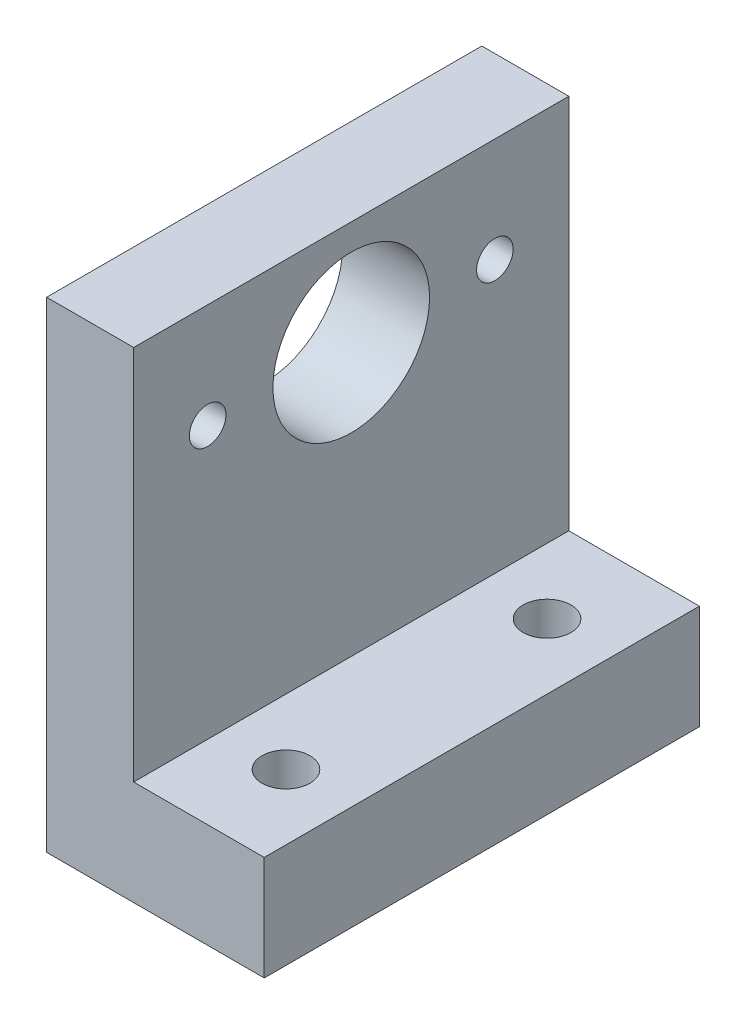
ISO-10303-21;
HEADER;
FILE_DESCRIPTION(('STEP AP214'),'2;1');
FILE_NAME('part.step','',(''),(''),'','','');
FILE_SCHEMA(('AUTOMOTIVE_DESIGN { 1 0 10303 214 1 1 1 1 }'));
ENDSEC;
DATA;
#1=APPLICATION_CONTEXT('core data for automotive mechanical design processes');
#2=APPLICATION_PROTOCOL_DEFINITION('international standard','automotive_design',2000,#1);
#3=PRODUCT_CONTEXT('',#1,'mechanical');
#4=PRODUCT('Part','Part','',(#3));
#5=PRODUCT_RELATED_PRODUCT_CATEGORY('part','',(#4));
#6=PRODUCT_DEFINITION_FORMATION('','',#4);
#7=PRODUCT_DEFINITION_CONTEXT('part definition',#1,'design');
#8=PRODUCT_DEFINITION('design','',#6,#7);
#9=PRODUCT_DEFINITION_SHAPE('','',#8);
#10=(LENGTH_UNIT() NAMED_UNIT(*) SI_UNIT(.MILLI.,.METRE.));
#11=(NAMED_UNIT(*) PLANE_ANGLE_UNIT() SI_UNIT($,.RADIAN.));
#12=(NAMED_UNIT(*) SI_UNIT($,.STERADIAN.) SOLID_ANGLE_UNIT());
#13=UNCERTAINTY_MEASURE_WITH_UNIT(LENGTH_MEASURE(1.E-05),#10,'distance_accuracy_value','');
#14=(GEOMETRIC_REPRESENTATION_CONTEXT(3) GLOBAL_UNCERTAINTY_ASSIGNED_CONTEXT((#13)) GLOBAL_UNIT_ASSIGNED_CONTEXT((#10,
#11,#12)) REPRESENTATION_CONTEXT('',''));
#15=CARTESIAN_POINT('',(0.,0.,0.));
#16=DIRECTION('',(0.,0.,1.));
#17=DIRECTION('',(1.,0.,0.));
#18=AXIS2_PLACEMENT_3D('',#15,#16,#17);
#19=CARTESIAN_POINT('',(0.,0.,50.));
#20=DIRECTION('',(0.,1.,0.));
#21=DIRECTION('',(0.,0.,1.));
#22=AXIS2_PLACEMENT_3D('',#19,#20,#21);
#23=PLANE('',#22);
#24=CARTESIAN_POINT('',(17.5,0.,40.));
#25=DIRECTION('',(0.,1.,0.));
#26=DIRECTION('',(0.,0.,1.));
#27=AXIS2_PLACEMENT_3D('',#24,#25,#26);
#28=CIRCLE('',#27,2.75);
#29=CARTESIAN_POINT('',(17.5,0.,42.75));
#30=VERTEX_POINT('',#29);
#31=EDGE_CURVE('E184',#30,#30,#28,.T.);
#32=ORIENTED_EDGE('',*,*,#31,.T.);
#33=EDGE_LOOP('',(#32));
#34=FACE_BOUND('',#33,.T.);
#35=CARTESIAN_POINT('',(17.5,0.,10.));
#36=DIRECTION('',(0.,1.,0.));
#37=DIRECTION('',(0.,0.,1.));
#38=AXIS2_PLACEMENT_3D('',#35,#36,#37);
#39=CIRCLE('',#38,2.75);
#40=CARTESIAN_POINT('',(17.5,0.,12.75));
#41=VERTEX_POINT('',#40);
#42=EDGE_CURVE('E187',#41,#41,#39,.T.);
#43=ORIENTED_EDGE('',*,*,#42,.T.);
#44=EDGE_LOOP('',(#43));
#45=FACE_BOUND('',#44,.T.);
#46=DIRECTION('',(0.,0.,-1.));
#47=VECTOR('',#46,1.);
#48=CARTESIAN_POINT('',(25.,0.,50.));
#49=LINE('',#48,#47);
#50=CARTESIAN_POINT('',(25.,0.,50.));
#51=VERTEX_POINT('',#50);
#52=CARTESIAN_POINT('',(25.,0.,0.));
#53=VERTEX_POINT('',#52);
#54=EDGE_CURVE('E12',#51,#53,#49,.T.);
#55=ORIENTED_EDGE('',*,*,#54,.F.);
#56=DIRECTION('',(1.,0.,0.));
#57=VECTOR('',#56,1.);
#58=CARTESIAN_POINT('',(0.,0.,50.));
#59=LINE('',#58,#57);
#60=CARTESIAN_POINT('',(0.,0.,50.));
#61=VERTEX_POINT('',#60);
#62=EDGE_CURVE('E86',#61,#51,#59,.T.);
#63=ORIENTED_EDGE('',*,*,#62,.F.);
#64=DIRECTION('',(0.,0.,-1.));
#65=VECTOR('',#64,1.);
#66=CARTESIAN_POINT('',(0.,0.,50.));
#67=LINE('',#66,#65);
#68=CARTESIAN_POINT('',(0.,0.,0.));
#69=VERTEX_POINT('',#68);
#70=EDGE_CURVE('E114',#61,#69,#67,.T.);
#71=ORIENTED_EDGE('',*,*,#70,.T.);
#72=DIRECTION('',(1.,0.,0.));
#73=VECTOR('',#72,1.);
#74=CARTESIAN_POINT('',(0.,0.,0.));
#75=LINE('',#74,#73);
#76=EDGE_CURVE('E118',#69,#53,#75,.T.);
#77=ORIENTED_EDGE('',*,*,#76,.T.);
#78=EDGE_LOOP('',(#55,#63,#71,#77));
#79=FACE_BOUND('',#78,.T.);
#80=ADVANCED_FACE('F33',(#34,#45,#79),#23,.F.);
#81=CARTESIAN_POINT('',(25.,0.,50.));
#82=DIRECTION('',(-1.,0.,0.));
#83=DIRECTION('',(0.,0.,1.));
#84=AXIS2_PLACEMENT_3D('',#81,#82,#83);
#85=PLANE('',#84);
#86=DIRECTION('',(0.,1.,0.));
#87=VECTOR('',#86,1.);
#88=CARTESIAN_POINT('',(25.,0.,0.));
#89=LINE('',#88,#87);
#90=CARTESIAN_POINT('',(25.,12.,0.));
#91=VERTEX_POINT('',#90);
#92=EDGE_CURVE('E120',#53,#91,#89,.T.);
#93=ORIENTED_EDGE('',*,*,#92,.T.);
#94=DIRECTION('',(0.,0.,-1.));
#95=VECTOR('',#94,1.);
#96=CARTESIAN_POINT('',(25.,12.,50.));
#97=LINE('',#96,#95);
#98=CARTESIAN_POINT('',(25.,12.,50.));
#99=VERTEX_POINT('',#98);
#100=EDGE_CURVE('E42',#99,#91,#97,.T.);
#101=ORIENTED_EDGE('',*,*,#100,.F.);
#102=DIRECTION('',(0.,1.,0.));
#103=VECTOR('',#102,1.);
#104=CARTESIAN_POINT('',(25.,0.,50.));
#105=LINE('',#104,#103);
#106=EDGE_CURVE('E152',#51,#99,#105,.T.);
#107=ORIENTED_EDGE('',*,*,#106,.F.);
#108=ORIENTED_EDGE('',*,*,#54,.T.);
#109=EDGE_LOOP('',(#93,#101,#107,#108));
#110=FACE_BOUND('',#109,.T.);
#111=ADVANCED_FACE('F156',(#110),#85,.F.);
#112=CARTESIAN_POINT('',(10.,12.,50.));
#113=DIRECTION('',(0.,-1.,0.));
#114=DIRECTION('',(0.,0.,-1.));
#115=AXIS2_PLACEMENT_3D('',#112,#113,#114);
#116=PLANE('',#115);
#117=CARTESIAN_POINT('',(17.5,12.,40.));
#118=DIRECTION('',(0.,1.,0.));
#119=DIRECTION('',(0.,0.,1.));
#120=AXIS2_PLACEMENT_3D('',#117,#118,#119);
#121=CIRCLE('',#120,2.75);
#122=CARTESIAN_POINT('',(17.5,12.,42.75));
#123=VERTEX_POINT('',#122);
#124=EDGE_CURVE('E195',#123,#123,#121,.T.);
#125=ORIENTED_EDGE('',*,*,#124,.F.);
#126=EDGE_LOOP('',(#125));
#127=FACE_BOUND('',#126,.T.);
#128=CARTESIAN_POINT('',(17.5,12.,10.));
#129=DIRECTION('',(0.,1.,0.));
#130=DIRECTION('',(0.,0.,1.));
#131=AXIS2_PLACEMENT_3D('',#128,#129,#130);
#132=CIRCLE('',#131,2.75);
#133=CARTESIAN_POINT('',(17.5,12.,12.75));
#134=VERTEX_POINT('',#133);
#135=EDGE_CURVE('E189',#134,#134,#132,.T.);
#136=ORIENTED_EDGE('',*,*,#135,.F.);
#137=EDGE_LOOP('',(#136));
#138=FACE_BOUND('',#137,.T.);
#139=DIRECTION('',(-1.,0.,0.));
#140=VECTOR('',#139,1.);
#141=CARTESIAN_POINT('',(10.,12.,0.));
#142=LINE('',#141,#140);
#143=CARTESIAN_POINT('',(10.,12.,0.));
#144=VERTEX_POINT('',#143);
#145=EDGE_CURVE('E123',#91,#144,#142,.T.);
#146=ORIENTED_EDGE('',*,*,#145,.T.);
#147=DIRECTION('',(0.,0.,-1.));
#148=VECTOR('',#147,1.);
#149=CARTESIAN_POINT('',(10.,12.,50.));
#150=LINE('',#149,#148);
#151=CARTESIAN_POINT('',(10.,12.,50.));
#152=VERTEX_POINT('',#151);
#153=EDGE_CURVE('E109',#152,#144,#150,.T.);
#154=ORIENTED_EDGE('',*,*,#153,.F.);
#155=DIRECTION('',(-1.,0.,0.));
#156=VECTOR('',#155,1.);
#157=CARTESIAN_POINT('',(10.,12.,50.));
#158=LINE('',#157,#156);
#159=EDGE_CURVE('E100',#99,#152,#158,.T.);
#160=ORIENTED_EDGE('',*,*,#159,.F.);
#161=ORIENTED_EDGE('',*,*,#100,.T.);
#162=EDGE_LOOP('',(#146,#154,#160,#161));
#163=FACE_BOUND('',#162,.T.);
#164=ADVANCED_FACE('F160',(#127,#138,#163),#116,.F.);
#165=CARTESIAN_POINT('',(10.,12.,50.));
#166=DIRECTION('',(-1.,0.,0.));
#167=DIRECTION('',(0.,0.,1.));
#168=AXIS2_PLACEMENT_3D('',#165,#166,#167);
#169=PLANE('',#168);
#170=CARTESIAN_POINT('',(10.,43.2400000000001,25.));
#171=DIRECTION('',(1.,0.,0.));
#172=DIRECTION('',(0.,0.,-1.));
#173=AXIS2_PLACEMENT_3D('',#170,#171,#172);
#174=CIRCLE('',#173,9.);
#175=CARTESIAN_POINT('',(10.,43.2400000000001,16.));
#176=VERTEX_POINT('',#175);
#177=EDGE_CURVE('E147',#176,#176,#174,.T.);
#178=ORIENTED_EDGE('',*,*,#177,.F.);
#179=EDGE_LOOP('',(#178));
#180=FACE_BOUND('',#179,.T.);
#181=CARTESIAN_POINT('',(10.,43.2400000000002,8.5));
#182=DIRECTION('',(1.,0.,0.));
#183=DIRECTION('',(0.,0.,-1.));
#184=AXIS2_PLACEMENT_3D('',#181,#182,#183);
#185=CIRCLE('',#184,2.1);
#186=CARTESIAN_POINT('',(10.,43.2400000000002,6.4));
#187=VERTEX_POINT('',#186);
#188=EDGE_CURVE('E137',#187,#187,#185,.T.);
#189=ORIENTED_EDGE('',*,*,#188,.F.);
#190=EDGE_LOOP('',(#189));
#191=FACE_BOUND('',#190,.T.);
#192=CARTESIAN_POINT('',(10.,43.2400000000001,41.5));
#193=DIRECTION('',(1.,0.,0.));
#194=DIRECTION('',(0.,0.,-1.));
#195=AXIS2_PLACEMENT_3D('',#192,#193,#194);
#196=CIRCLE('',#195,2.1);
#197=CARTESIAN_POINT('',(10.,43.2400000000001,39.4));
#198=VERTEX_POINT('',#197);
#199=EDGE_CURVE('E134',#198,#198,#196,.T.);
#200=ORIENTED_EDGE('',*,*,#199,.F.);
#201=EDGE_LOOP('',(#200));
#202=FACE_BOUND('',#201,.T.);
#203=DIRECTION('',(0.,1.,0.));
#204=VECTOR('',#203,1.);
#205=CARTESIAN_POINT('',(10.,12.,0.));
#206=LINE('',#205,#204);
#207=CARTESIAN_POINT('',(10.,55.24,0.));
#208=VERTEX_POINT('',#207);
#209=EDGE_CURVE('E108',#144,#208,#206,.T.);
#210=ORIENTED_EDGE('',*,*,#209,.T.);
#211=DIRECTION('',(0.,0.,-1.));
#212=VECTOR('',#211,1.);
#213=CARTESIAN_POINT('',(10.,55.24,50.));
#214=LINE('',#213,#212);
#215=CARTESIAN_POINT('',(10.,55.24,50.));
#216=VERTEX_POINT('',#215);
#217=EDGE_CURVE('E105',#216,#208,#214,.T.);
#218=ORIENTED_EDGE('',*,*,#217,.F.);
#219=DIRECTION('',(0.,1.,0.));
#220=VECTOR('',#219,1.);
#221=CARTESIAN_POINT('',(10.,12.,50.));
#222=LINE('',#221,#220);
#223=EDGE_CURVE('E94',#152,#216,#222,.T.);
#224=ORIENTED_EDGE('',*,*,#223,.F.);
#225=ORIENTED_EDGE('',*,*,#153,.T.);
#226=EDGE_LOOP('',(#210,#218,#224,#225));
#227=FACE_BOUND('',#226,.T.);
#228=ADVANCED_FACE('F106',(#180,#191,#202,#227),#169,.F.);
#229=CARTESIAN_POINT('',(0.,55.24,50.));
#230=DIRECTION('',(0.,-1.,0.));
#231=DIRECTION('',(0.,0.,-1.));
#232=AXIS2_PLACEMENT_3D('',#229,#230,#231);
#233=PLANE('',#232);
#234=DIRECTION('',(-1.,0.,0.));
#235=VECTOR('',#234,1.);
#236=CARTESIAN_POINT('',(0.,55.24,0.));
#237=LINE('',#236,#235);
#238=CARTESIAN_POINT('',(0.,55.24,0.));
#239=VERTEX_POINT('',#238);
#240=EDGE_CURVE('E74',#208,#239,#237,.T.);
#241=ORIENTED_EDGE('',*,*,#240,.T.);
#242=DIRECTION('',(0.,0.,-1.));
#243=VECTOR('',#242,1.);
#244=CARTESIAN_POINT('',(0.,55.24,50.));
#245=LINE('',#244,#243);
#246=CARTESIAN_POINT('',(0.,55.24,50.));
#247=VERTEX_POINT('',#246);
#248=EDGE_CURVE('E110',#247,#239,#245,.T.);
#249=ORIENTED_EDGE('',*,*,#248,.F.);
#250=DIRECTION('',(-1.,0.,0.));
#251=VECTOR('',#250,1.);
#252=CARTESIAN_POINT('',(0.,55.24,50.));
#253=LINE('',#252,#251);
#254=EDGE_CURVE('E98',#216,#247,#253,.T.);
#255=ORIENTED_EDGE('',*,*,#254,.F.);
#256=ORIENTED_EDGE('',*,*,#217,.T.);
#257=EDGE_LOOP('',(#241,#249,#255,#256));
#258=FACE_BOUND('',#257,.T.);
#259=ADVANCED_FACE('F112',(#258),#233,.F.);
#260=CARTESIAN_POINT('',(0.,0.,50.));
#261=DIRECTION('',(1.,0.,0.));
#262=DIRECTION('',(0.,0.,-1.));
#263=AXIS2_PLACEMENT_3D('',#260,#261,#262);
#264=PLANE('',#263);
#265=CARTESIAN_POINT('',(0.,43.2400000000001,25.));
#266=DIRECTION('',(1.,0.,0.));
#267=DIRECTION('',(0.,0.,-1.));
#268=AXIS2_PLACEMENT_3D('',#265,#266,#267);
#269=CIRCLE('',#268,9.);
#270=CARTESIAN_POINT('',(0.,43.2400000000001,16.));
#271=VERTEX_POINT('',#270);
#272=EDGE_CURVE('E36',#271,#271,#269,.T.);
#273=ORIENTED_EDGE('',*,*,#272,.T.);
#274=EDGE_LOOP('',(#273));
#275=FACE_BOUND('',#274,.T.);
#276=CARTESIAN_POINT('',(0.,43.2400000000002,8.5));
#277=DIRECTION('',(1.,0.,0.));
#278=DIRECTION('',(0.,0.,-1.));
#279=AXIS2_PLACEMENT_3D('',#276,#277,#278);
#280=CIRCLE('',#279,2.1);
#281=CARTESIAN_POINT('',(0.,43.2400000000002,6.4));
#282=VERTEX_POINT('',#281);
#283=EDGE_CURVE('E135',#282,#282,#280,.T.);
#284=ORIENTED_EDGE('',*,*,#283,.T.);
#285=EDGE_LOOP('',(#284));
#286=FACE_BOUND('',#285,.T.);
#287=CARTESIAN_POINT('',(0.,43.2400000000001,41.5));
#288=DIRECTION('',(1.,0.,0.));
#289=DIRECTION('',(0.,0.,-1.));
#290=AXIS2_PLACEMENT_3D('',#287,#288,#289);
#291=CIRCLE('',#290,2.1);
#292=CARTESIAN_POINT('',(0.,43.2400000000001,39.4));
#293=VERTEX_POINT('',#292);
#294=EDGE_CURVE('E121',#293,#293,#291,.T.);
#295=ORIENTED_EDGE('',*,*,#294,.T.);
#296=EDGE_LOOP('',(#295));
#297=FACE_BOUND('',#296,.T.);
#298=DIRECTION('',(0.,-1.,0.));
#299=VECTOR('',#298,1.);
#300=CARTESIAN_POINT('',(0.,0.,0.));
#301=LINE('',#300,#299);
#302=EDGE_CURVE('E80',#239,#69,#301,.T.);
#303=ORIENTED_EDGE('',*,*,#302,.T.);
#304=ORIENTED_EDGE('',*,*,#70,.F.);
#305=DIRECTION('',(0.,-1.,0.));
#306=VECTOR('',#305,1.);
#307=CARTESIAN_POINT('',(0.,0.,50.));
#308=LINE('',#307,#306);
#309=EDGE_CURVE('E51',#247,#61,#308,.T.);
#310=ORIENTED_EDGE('',*,*,#309,.F.);
#311=ORIENTED_EDGE('',*,*,#248,.T.);
#312=EDGE_LOOP('',(#303,#304,#310,#311));
#313=FACE_BOUND('',#312,.T.);
#314=ADVANCED_FACE('F165',(#275,#286,#297,#313),#264,.F.);
#315=CARTESIAN_POINT('',(25.,0.,50.));
#316=DIRECTION('',(0.,0.,1.));
#317=DIRECTION('',(1.,0.,0.));
#318=AXIS2_PLACEMENT_3D('',#315,#316,#317);
#319=PLANE('',#318);
#320=ORIENTED_EDGE('',*,*,#159,.T.);
#321=ORIENTED_EDGE('',*,*,#223,.T.);
#322=ORIENTED_EDGE('',*,*,#254,.T.);
#323=ORIENTED_EDGE('',*,*,#309,.T.);
#324=ORIENTED_EDGE('',*,*,#62,.T.);
#325=ORIENTED_EDGE('',*,*,#106,.T.);
#326=EDGE_LOOP('',(#320,#321,#322,#323,#324,#325));
#327=FACE_BOUND('',#326,.T.);
#328=ADVANCED_FACE('F96',(#327),#319,.T.);
#329=CARTESIAN_POINT('',(25.,0.,0.));
#330=DIRECTION('',(0.,0.,1.));
#331=DIRECTION('',(1.,0.,0.));
#332=AXIS2_PLACEMENT_3D('',#329,#330,#331);
#333=PLANE('',#332);
#334=ORIENTED_EDGE('',*,*,#92,.F.);
#335=ORIENTED_EDGE('',*,*,#76,.F.);
#336=ORIENTED_EDGE('',*,*,#302,.F.);
#337=ORIENTED_EDGE('',*,*,#240,.F.);
#338=ORIENTED_EDGE('',*,*,#209,.F.);
#339=ORIENTED_EDGE('',*,*,#145,.F.);
#340=EDGE_LOOP('',(#334,#335,#336,#337,#338,#339));
#341=FACE_BOUND('',#340,.T.);
#342=ADVANCED_FACE('F162',(#341),#333,.F.);
#343=CARTESIAN_POINT('',(-40.,43.2400000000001,41.5));
#344=DIRECTION('',(1.,0.,0.));
#345=DIRECTION('',(0.,0.,-1.));
#346=AXIS2_PLACEMENT_3D('',#343,#344,#345);
#347=CYLINDRICAL_SURFACE('',#346,2.1);
#348=ORIENTED_EDGE('',*,*,#199,.T.);
#349=EDGE_LOOP('',(#348));
#350=FACE_BOUND('',#349,.T.);
#351=ORIENTED_EDGE('',*,*,#294,.F.);
#352=EDGE_LOOP('',(#351));
#353=FACE_BOUND('',#352,.T.);
#354=ADVANCED_FACE('F222',(#350,#353),#347,.F.);
#355=CARTESIAN_POINT('',(-40.,43.2400000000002,8.5));
#356=DIRECTION('',(1.,0.,0.));
#357=DIRECTION('',(0.,0.,-1.));
#358=AXIS2_PLACEMENT_3D('',#355,#356,#357);
#359=CYLINDRICAL_SURFACE('',#358,2.1);
#360=ORIENTED_EDGE('',*,*,#188,.T.);
#361=EDGE_LOOP('',(#360));
#362=FACE_BOUND('',#361,.T.);
#363=ORIENTED_EDGE('',*,*,#283,.F.);
#364=EDGE_LOOP('',(#363));
#365=FACE_BOUND('',#364,.T.);
#366=ADVANCED_FACE('F216',(#362,#365),#359,.F.);
#367=CARTESIAN_POINT('',(-40.,43.2400000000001,25.));
#368=DIRECTION('',(1.,0.,0.));
#369=DIRECTION('',(0.,0.,-1.));
#370=AXIS2_PLACEMENT_3D('',#367,#368,#369);
#371=CYLINDRICAL_SURFACE('',#370,9.);
#372=ORIENTED_EDGE('',*,*,#177,.T.);
#373=EDGE_LOOP('',(#372));
#374=FACE_BOUND('',#373,.T.);
#375=ORIENTED_EDGE('',*,*,#272,.F.);
#376=EDGE_LOOP('',(#375));
#377=FACE_BOUND('',#376,.T.);
#378=ADVANCED_FACE('F209',(#374,#377),#371,.F.);
#379=CARTESIAN_POINT('',(17.5,-38.,10.));
#380=DIRECTION('',(0.,1.,0.));
#381=DIRECTION('',(0.,0.,1.));
#382=AXIS2_PLACEMENT_3D('',#379,#380,#381);
#383=CYLINDRICAL_SURFACE('',#382,2.75);
#384=ORIENTED_EDGE('',*,*,#135,.T.);
#385=EDGE_LOOP('',(#384));
#386=FACE_BOUND('',#385,.T.);
#387=ORIENTED_EDGE('',*,*,#42,.F.);
#388=EDGE_LOOP('',(#387));
#389=FACE_BOUND('',#388,.T.);
#390=ADVANCED_FACE('F207',(#386,#389),#383,.F.);
#391=CARTESIAN_POINT('',(17.5,-38.,40.));
#392=DIRECTION('',(0.,1.,0.));
#393=DIRECTION('',(0.,0.,1.));
#394=AXIS2_PLACEMENT_3D('',#391,#392,#393);
#395=CYLINDRICAL_SURFACE('',#394,2.75);
#396=ORIENTED_EDGE('',*,*,#124,.T.);
#397=EDGE_LOOP('',(#396));
#398=FACE_BOUND('',#397,.T.);
#399=ORIENTED_EDGE('',*,*,#31,.F.);
#400=EDGE_LOOP('',(#399));
#401=FACE_BOUND('',#400,.T.);
#402=ADVANCED_FACE('F199',(#398,#401),#395,.F.);
#403=CLOSED_SHELL('',(#80,#111,#164,#228,#259,#314,#328,#342,#354,#366,#378,#390,#402));
#404=MANIFOLD_SOLID_BREP('B2',#403);
#405=ADVANCED_BREP_SHAPE_REPRESENTATION('',(#18,#404),#14);
#406=SHAPE_DEFINITION_REPRESENTATION(#9,#405);
ENDSEC;
END-ISO-10303-21;
